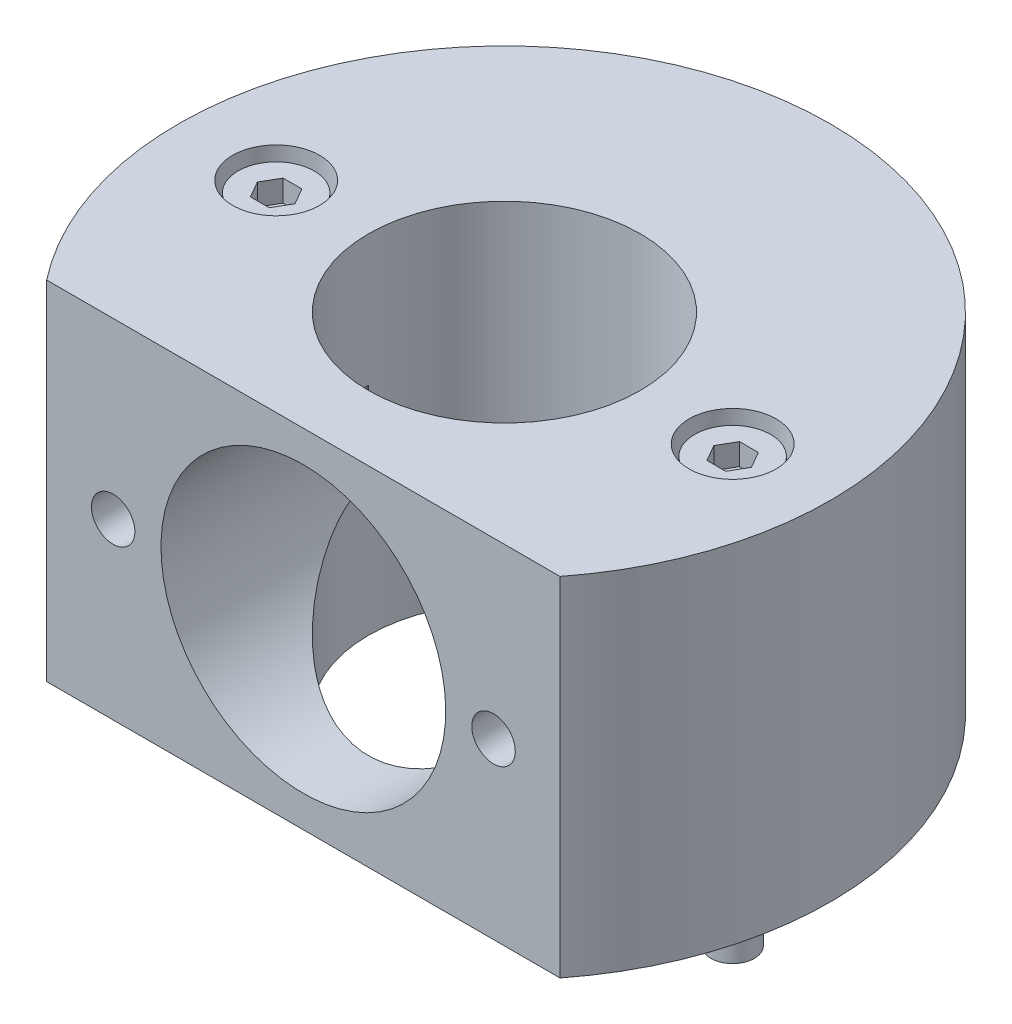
ISO-10303-21;
HEADER;
FILE_DESCRIPTION(('STEP AP214'),'2;1');
FILE_NAME('part.step','',(''),(''),'','','');
FILE_SCHEMA(('AUTOMOTIVE_DESIGN { 1 0 10303 214 1 1 1 1 }'));
ENDSEC;
DATA;
#1=APPLICATION_CONTEXT('core data for automotive mechanical design processes');
#2=APPLICATION_PROTOCOL_DEFINITION('international standard','automotive_design',2000,#1);
#3=PRODUCT_CONTEXT('',#1,'mechanical');
#4=PRODUCT('Part','Part','',(#3));
#5=PRODUCT_RELATED_PRODUCT_CATEGORY('part','',(#4));
#6=PRODUCT_DEFINITION_FORMATION('','',#4);
#7=PRODUCT_DEFINITION_CONTEXT('part definition',#1,'design');
#8=PRODUCT_DEFINITION('design','',#6,#7);
#9=PRODUCT_DEFINITION_SHAPE('','',#8);
#10=(LENGTH_UNIT() NAMED_UNIT(*) SI_UNIT(.MILLI.,.METRE.));
#11=(NAMED_UNIT(*) PLANE_ANGLE_UNIT() SI_UNIT($,.RADIAN.));
#12=(NAMED_UNIT(*) SI_UNIT($,.STERADIAN.) SOLID_ANGLE_UNIT());
#13=UNCERTAINTY_MEASURE_WITH_UNIT(LENGTH_MEASURE(1.E-05),#10,'distance_accuracy_value','');
#14=(GEOMETRIC_REPRESENTATION_CONTEXT(3) GLOBAL_UNCERTAINTY_ASSIGNED_CONTEXT((#13)) GLOBAL_UNIT_ASSIGNED_CONTEXT((#10,
#11,#12)) REPRESENTATION_CONTEXT('',''));
#15=CARTESIAN_POINT('',(0.,0.,0.));
#16=DIRECTION('',(0.,0.,1.));
#17=DIRECTION('',(1.,0.,0.));
#18=AXIS2_PLACEMENT_3D('',#15,#16,#17);
#19=CARTESIAN_POINT('',(-21.,-8.00000000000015,2.));
#20=DIRECTION('',(0.,-1.,0.));
#21=DIRECTION('',(0.,0.,-1.));
#22=AXIS2_PLACEMENT_3D('',#19,#20,#21);
#23=PLANE('',#22);
#24=CARTESIAN_POINT('',(-21.,-8.00000000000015,0.));
#25=DIRECTION('',(0.,1.,0.));
#26=DIRECTION('',(0.,0.,1.));
#27=AXIS2_PLACEMENT_3D('',#24,#25,#26);
#28=CIRCLE('',#27,2.);
#29=CARTESIAN_POINT('',(-21.,-8.00000000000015,2.));
#30=VERTEX_POINT('',#29);
#31=EDGE_CURVE('E339',#30,#30,#28,.T.);
#32=ORIENTED_EDGE('',*,*,#31,.F.);
#33=EDGE_LOOP('',(#32));
#34=FACE_BOUND('',#33,.T.);
#35=ADVANCED_FACE('F14',(#34),#23,.T.);
#36=CARTESIAN_POINT('',(-21.,11.9999999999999,0.));
#37=DIRECTION('',(0.,1.,0.));
#38=DIRECTION('',(0.,0.,1.));
#39=AXIS2_PLACEMENT_3D('',#36,#37,#38);
#40=CYLINDRICAL_SURFACE('',#39,2.);
#41=ORIENTED_EDGE('',*,*,#31,.T.);
#42=EDGE_LOOP('',(#41));
#43=FACE_BOUND('',#42,.T.);
#44=CARTESIAN_POINT('',(-21.,27.,0.));
#45=DIRECTION('',(0.,1.,0.));
#46=DIRECTION('',(0.,0.,1.));
#47=AXIS2_PLACEMENT_3D('',#44,#45,#46);
#48=CIRCLE('',#47,2.);
#49=CARTESIAN_POINT('',(-21.,27.,2.));
#50=VERTEX_POINT('',#49);
#51=EDGE_CURVE('E342',#50,#50,#48,.T.);
#52=ORIENTED_EDGE('',*,*,#51,.F.);
#53=EDGE_LOOP('',(#52));
#54=FACE_BOUND('',#53,.T.);
#55=ADVANCED_FACE('F258',(#43,#54),#40,.T.);
#56=CARTESIAN_POINT('',(-21.,27.,3.5));
#57=DIRECTION('',(0.,-1.,0.));
#58=DIRECTION('',(0.,0.,-1.));
#59=AXIS2_PLACEMENT_3D('',#56,#57,#58);
#60=PLANE('',#59);
#61=ORIENTED_EDGE('',*,*,#51,.T.);
#62=EDGE_LOOP('',(#61));
#63=FACE_BOUND('',#62,.T.);
#64=CARTESIAN_POINT('',(-21.,27.,0.));
#65=DIRECTION('',(0.,-1.,0.));
#66=DIRECTION('',(0.,0.,1.));
#67=AXIS2_PLACEMENT_3D('',#64,#65,#66);
#68=CIRCLE('',#67,2.25);
#69=CARTESIAN_POINT('',(-21.,27.,2.25));
#70=VERTEX_POINT('',#69);
#71=EDGE_CURVE('E9',#70,#70,#68,.T.);
#72=ORIENTED_EDGE('',*,*,#71,.T.);
#73=EDGE_LOOP('',(#72));
#74=FACE_BOUND('',#73,.T.);
#75=ADVANCED_FACE('F219',(#63,#74),#60,.T.);
#76=CARTESIAN_POINT('',(-19.2679491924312,29.,0.));
#77=DIRECTION('',(-0.86602540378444,0.,-0.5));
#78=DIRECTION('',(-0.5,0.,0.86602540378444));
#79=AXIS2_PLACEMENT_3D('',#76,#77,#78);
#80=PLANE('',#79);
#81=DIRECTION('',(0.,1.,0.));
#82=VECTOR('',#81,1.);
#83=CARTESIAN_POINT('',(-20.1339745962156,29.,1.5));
#84=LINE('',#83,#82);
#85=CARTESIAN_POINT('',(-20.1339745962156,29.,1.5));
#86=VERTEX_POINT('',#85);
#87=CARTESIAN_POINT('',(-20.1339745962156,31.,1.5));
#88=VERTEX_POINT('',#87);
#89=EDGE_CURVE('E337',#86,#88,#84,.T.);
#90=ORIENTED_EDGE('',*,*,#89,.T.);
#91=DIRECTION('',(-0.5,0.,0.86602540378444));
#92=VECTOR('',#91,1.);
#93=CARTESIAN_POINT('',(-19.2679491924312,31.,0.));
#94=LINE('',#93,#92);
#95=CARTESIAN_POINT('',(-19.2679491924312,31.,0.));
#96=VERTEX_POINT('',#95);
#97=EDGE_CURVE('E33',#96,#88,#94,.T.);
#98=ORIENTED_EDGE('',*,*,#97,.F.);
#99=DIRECTION('',(0.,1.,0.));
#100=VECTOR('',#99,1.);
#101=CARTESIAN_POINT('',(-19.2679491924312,29.,0.));
#102=LINE('',#101,#100);
#103=CARTESIAN_POINT('',(-19.2679491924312,29.,0.));
#104=VERTEX_POINT('',#103);
#105=EDGE_CURVE('E309',#104,#96,#102,.T.);
#106=ORIENTED_EDGE('',*,*,#105,.F.);
#107=DIRECTION('',(-0.5,0.,0.86602540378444));
#108=VECTOR('',#107,1.);
#109=CARTESIAN_POINT('',(-19.2679491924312,29.,0.));
#110=LINE('',#109,#108);
#111=EDGE_CURVE('E297',#104,#86,#110,.T.);
#112=ORIENTED_EDGE('',*,*,#111,.T.);
#113=EDGE_LOOP('',(#90,#98,#106,#112));
#114=FACE_BOUND('',#113,.T.);
#115=ADVANCED_FACE('F209',(#114),#80,.T.);
#116=CARTESIAN_POINT('',(-21.8660254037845,29.,1.5));
#117=DIRECTION('',(0.,0.,1.));
#118=DIRECTION('',(1.,0.,0.));
#119=AXIS2_PLACEMENT_3D('',#116,#117,#118);
#120=PLANE('',#119);
#121=DIRECTION('',(0.,1.,0.));
#122=VECTOR('',#121,1.);
#123=CARTESIAN_POINT('',(-21.8660254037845,29.,1.5));
#124=LINE('',#123,#122);
#125=CARTESIAN_POINT('',(-21.8660254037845,29.,1.5));
#126=VERTEX_POINT('',#125);
#127=CARTESIAN_POINT('',(-21.8660254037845,31.,1.5));
#128=VERTEX_POINT('',#127);
#129=EDGE_CURVE('E334',#126,#128,#124,.T.);
#130=ORIENTED_EDGE('',*,*,#129,.T.);
#131=DIRECTION('',(1.,0.,0.));
#132=VECTOR('',#131,1.);
#133=CARTESIAN_POINT('',(-21.8660254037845,31.,1.5));
#134=LINE('',#133,#132);
#135=EDGE_CURVE('E808',#128,#88,#134,.T.);
#136=ORIENTED_EDGE('',*,*,#135,.T.);
#137=ORIENTED_EDGE('',*,*,#89,.F.);
#138=DIRECTION('',(1.,0.,0.));
#139=VECTOR('',#138,1.);
#140=CARTESIAN_POINT('',(-21.8660254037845,29.,1.5));
#141=LINE('',#140,#139);
#142=EDGE_CURVE('E304',#126,#86,#141,.T.);
#143=ORIENTED_EDGE('',*,*,#142,.F.);
#144=EDGE_LOOP('',(#130,#136,#137,#143));
#145=FACE_BOUND('',#144,.T.);
#146=ADVANCED_FACE('F266',(#145),#120,.F.);
#147=CARTESIAN_POINT('',(-22.732050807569,29.,0.));
#148=DIRECTION('',(-0.86602540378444,0.,0.5));
#149=DIRECTION('',(0.5,0.,0.86602540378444));
#150=AXIS2_PLACEMENT_3D('',#147,#148,#149);
#151=PLANE('',#150);
#152=DIRECTION('',(0.,1.,0.));
#153=VECTOR('',#152,1.);
#154=CARTESIAN_POINT('',(-22.732050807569,29.,0.));
#155=LINE('',#154,#153);
#156=CARTESIAN_POINT('',(-22.732050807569,29.,0.));
#157=VERTEX_POINT('',#156);
#158=CARTESIAN_POINT('',(-22.732050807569,31.,0.));
#159=VERTEX_POINT('',#158);
#160=EDGE_CURVE('E331',#157,#159,#155,.T.);
#161=ORIENTED_EDGE('',*,*,#160,.T.);
#162=DIRECTION('',(0.5,0.,0.86602540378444));
#163=VECTOR('',#162,1.);
#164=CARTESIAN_POINT('',(-22.732050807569,31.,0.));
#165=LINE('',#164,#163);
#166=EDGE_CURVE('E812',#159,#128,#165,.T.);
#167=ORIENTED_EDGE('',*,*,#166,.T.);
#168=ORIENTED_EDGE('',*,*,#129,.F.);
#169=DIRECTION('',(0.5,0.,0.86602540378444));
#170=VECTOR('',#169,1.);
#171=CARTESIAN_POINT('',(-22.732050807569,29.,0.));
#172=LINE('',#171,#170);
#173=EDGE_CURVE('E324',#157,#126,#172,.T.);
#174=ORIENTED_EDGE('',*,*,#173,.F.);
#175=EDGE_LOOP('',(#161,#167,#168,#174));
#176=FACE_BOUND('',#175,.T.);
#177=ADVANCED_FACE('F269',(#176),#151,.F.);
#178=CARTESIAN_POINT('',(-22.732050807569,29.,0.));
#179=DIRECTION('',(0.86602540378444,0.,0.5));
#180=DIRECTION('',(0.5,0.,-0.86602540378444));
#181=AXIS2_PLACEMENT_3D('',#178,#179,#180);
#182=PLANE('',#181);
#183=DIRECTION('',(0.,1.,0.));
#184=VECTOR('',#183,1.);
#185=CARTESIAN_POINT('',(-21.8660254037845,29.,-1.5));
#186=LINE('',#185,#184);
#187=CARTESIAN_POINT('',(-21.8660254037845,29.,-1.5));
#188=VERTEX_POINT('',#187);
#189=CARTESIAN_POINT('',(-21.8660254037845,31.,-1.5));
#190=VERTEX_POINT('',#189);
#191=EDGE_CURVE('E328',#188,#190,#186,.T.);
#192=ORIENTED_EDGE('',*,*,#191,.T.);
#193=DIRECTION('',(0.5,0.,-0.86602540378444));
#194=VECTOR('',#193,1.);
#195=CARTESIAN_POINT('',(-22.732050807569,31.,0.));
#196=LINE('',#195,#194);
#197=EDGE_CURVE('E815',#159,#190,#196,.T.);
#198=ORIENTED_EDGE('',*,*,#197,.F.);
#199=ORIENTED_EDGE('',*,*,#160,.F.);
#200=DIRECTION('',(0.5,0.,-0.86602540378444));
#201=VECTOR('',#200,1.);
#202=CARTESIAN_POINT('',(-22.732050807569,29.,0.));
#203=LINE('',#202,#201);
#204=EDGE_CURVE('E317',#157,#188,#203,.T.);
#205=ORIENTED_EDGE('',*,*,#204,.T.);
#206=EDGE_LOOP('',(#192,#198,#199,#205));
#207=FACE_BOUND('',#206,.T.);
#208=ADVANCED_FACE('F273',(#207),#182,.T.);
#209=CARTESIAN_POINT('',(-20.1339745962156,29.,-1.5));
#210=DIRECTION('',(0.,0.,-1.));
#211=DIRECTION('',(-1.,0.,0.));
#212=AXIS2_PLACEMENT_3D('',#209,#210,#211);
#213=PLANE('',#212);
#214=DIRECTION('',(0.,1.,0.));
#215=VECTOR('',#214,1.);
#216=CARTESIAN_POINT('',(-20.1339745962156,29.,-1.5));
#217=LINE('',#216,#215);
#218=CARTESIAN_POINT('',(-20.1339745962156,29.,-1.5));
#219=VERTEX_POINT('',#218);
#220=CARTESIAN_POINT('',(-20.1339745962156,31.,-1.5));
#221=VERTEX_POINT('',#220);
#222=EDGE_CURVE('E312',#219,#221,#217,.T.);
#223=ORIENTED_EDGE('',*,*,#222,.T.);
#224=DIRECTION('',(-1.,0.,0.));
#225=VECTOR('',#224,1.);
#226=CARTESIAN_POINT('',(-20.1339745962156,31.,-1.5));
#227=LINE('',#226,#225);
#228=EDGE_CURVE('E820',#221,#190,#227,.T.);
#229=ORIENTED_EDGE('',*,*,#228,.T.);
#230=ORIENTED_EDGE('',*,*,#191,.F.);
#231=DIRECTION('',(-1.,0.,0.));
#232=VECTOR('',#231,1.);
#233=CARTESIAN_POINT('',(-20.1339745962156,29.,-1.5));
#234=LINE('',#233,#232);
#235=EDGE_CURVE('E314',#219,#188,#234,.T.);
#236=ORIENTED_EDGE('',*,*,#235,.F.);
#237=EDGE_LOOP('',(#223,#229,#230,#236));
#238=FACE_BOUND('',#237,.T.);
#239=ADVANCED_FACE('F277',(#238),#213,.F.);
#240=CARTESIAN_POINT('',(-19.2679491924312,29.,0.));
#241=DIRECTION('',(0.86602540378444,0.,-0.5));
#242=DIRECTION('',(-0.5,0.,-0.86602540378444));
#243=AXIS2_PLACEMENT_3D('',#240,#241,#242);
#244=PLANE('',#243);
#245=DIRECTION('',(-0.5,0.,-0.86602540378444));
#246=VECTOR('',#245,1.);
#247=CARTESIAN_POINT('',(-19.2679491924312,29.,0.));
#248=LINE('',#247,#246);
#249=EDGE_CURVE('E300',#104,#219,#248,.T.);
#250=ORIENTED_EDGE('',*,*,#249,.F.);
#251=ORIENTED_EDGE('',*,*,#105,.T.);
#252=DIRECTION('',(-0.5,0.,-0.86602540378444));
#253=VECTOR('',#252,1.);
#254=CARTESIAN_POINT('',(-19.2679491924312,31.,0.));
#255=LINE('',#254,#253);
#256=EDGE_CURVE('E305',#96,#221,#255,.T.);
#257=ORIENTED_EDGE('',*,*,#256,.T.);
#258=ORIENTED_EDGE('',*,*,#222,.F.);
#259=EDGE_LOOP('',(#250,#251,#257,#258));
#260=FACE_BOUND('',#259,.T.);
#261=ADVANCED_FACE('F252',(#260),#244,.F.);
#262=CARTESIAN_POINT('',(-20.1339745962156,29.,1.5));
#263=DIRECTION('',(0.,1.,0.));
#264=DIRECTION('',(0.,0.,1.));
#265=AXIS2_PLACEMENT_3D('',#262,#263,#264);
#266=PLANE('',#265);
#267=ORIENTED_EDGE('',*,*,#111,.F.);
#268=ORIENTED_EDGE('',*,*,#249,.T.);
#269=ORIENTED_EDGE('',*,*,#235,.T.);
#270=ORIENTED_EDGE('',*,*,#204,.F.);
#271=ORIENTED_EDGE('',*,*,#173,.T.);
#272=ORIENTED_EDGE('',*,*,#142,.T.);
#273=EDGE_LOOP('',(#267,#268,#269,#270,#271,#272));
#274=FACE_BOUND('',#273,.T.);
#275=ADVANCED_FACE('F250',(#274),#266,.T.);
#276=CARTESIAN_POINT('',(-21.,31.,0.));
#277=DIRECTION('',(0.,1.,0.));
#278=DIRECTION('',(0.,0.,1.));
#279=AXIS2_PLACEMENT_3D('',#276,#277,#278);
#280=PLANE('',#279);
#281=CARTESIAN_POINT('',(-21.,31.,0.));
#282=DIRECTION('',(0.,1.,0.));
#283=DIRECTION('',(0.,0.,1.));
#284=AXIS2_PLACEMENT_3D('',#281,#282,#283);
#285=CIRCLE('',#284,3.5);
#286=CARTESIAN_POINT('',(-21.,31.,3.5));
#287=VERTEX_POINT('',#286);
#288=EDGE_CURVE('E24',#287,#287,#285,.T.);
#289=ORIENTED_EDGE('',*,*,#288,.T.);
#290=EDGE_LOOP('',(#289));
#291=FACE_BOUND('',#290,.T.);
#292=ORIENTED_EDGE('',*,*,#256,.F.);
#293=ORIENTED_EDGE('',*,*,#97,.T.);
#294=ORIENTED_EDGE('',*,*,#135,.F.);
#295=ORIENTED_EDGE('',*,*,#166,.F.);
#296=ORIENTED_EDGE('',*,*,#197,.T.);
#297=ORIENTED_EDGE('',*,*,#228,.F.);
#298=EDGE_LOOP('',(#292,#293,#294,#295,#296,#297));
#299=FACE_BOUND('',#298,.T.);
#300=ADVANCED_FACE('F247',(#291,#299),#280,.T.);
#301=CARTESIAN_POINT('',(-21.,11.9999999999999,0.));
#302=DIRECTION('',(0.,1.,0.));
#303=DIRECTION('',(0.,0.,1.));
#304=AXIS2_PLACEMENT_3D('',#301,#302,#303);
#305=CYLINDRICAL_SURFACE('',#304,3.5);
#306=CARTESIAN_POINT('',(-21.,27.,0.));
#307=DIRECTION('',(0.,1.,0.));
#308=DIRECTION('',(0.,0.,1.));
#309=AXIS2_PLACEMENT_3D('',#306,#307,#308);
#310=CIRCLE('',#309,3.5);
#311=CARTESIAN_POINT('',(-21.,27.,3.5));
#312=VERTEX_POINT('',#311);
#313=EDGE_CURVE('E345',#312,#312,#310,.T.);
#314=ORIENTED_EDGE('',*,*,#313,.T.);
#315=EDGE_LOOP('',(#314));
#316=FACE_BOUND('',#315,.T.);
#317=ORIENTED_EDGE('',*,*,#288,.F.);
#318=EDGE_LOOP('',(#317));
#319=FACE_BOUND('',#318,.T.);
#320=ADVANCED_FACE('F245',(#316,#319),#305,.T.);
#321=CARTESIAN_POINT('',(21.8660254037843,29.,1.5));
#322=DIRECTION('',(0.,1.,0.));
#323=DIRECTION('',(0.,0.,1.));
#324=AXIS2_PLACEMENT_3D('',#321,#322,#323);
#325=PLANE('',#324);
#326=DIRECTION('',(-0.5,0.,0.86602540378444));
#327=VECTOR('',#326,1.);
#328=CARTESIAN_POINT('',(22.7320508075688,29.,0.));
#329=LINE('',#328,#327);
#330=CARTESIAN_POINT('',(22.7320508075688,29.,0.));
#331=VERTEX_POINT('',#330);
#332=CARTESIAN_POINT('',(21.8660254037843,29.,1.5));
#333=VERTEX_POINT('',#332);
#334=EDGE_CURVE('E353',#331,#333,#329,.T.);
#335=ORIENTED_EDGE('',*,*,#334,.F.);
#336=DIRECTION('',(-0.5,0.,-0.86602540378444));
#337=VECTOR('',#336,1.);
#338=CARTESIAN_POINT('',(22.7320508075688,29.,0.));
#339=LINE('',#338,#337);
#340=CARTESIAN_POINT('',(21.8660254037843,29.,-1.5));
#341=VERTEX_POINT('',#340);
#342=EDGE_CURVE('E369',#331,#341,#339,.T.);
#343=ORIENTED_EDGE('',*,*,#342,.T.);
#344=DIRECTION('',(-1.,0.,0.));
#345=VECTOR('',#344,1.);
#346=CARTESIAN_POINT('',(21.8660254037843,29.,-1.5));
#347=LINE('',#346,#345);
#348=CARTESIAN_POINT('',(20.1339745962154,29.,-1.5));
#349=VERTEX_POINT('',#348);
#350=EDGE_CURVE('E373',#341,#349,#347,.T.);
#351=ORIENTED_EDGE('',*,*,#350,.T.);
#352=DIRECTION('',(0.5,0.,-0.86602540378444));
#353=VECTOR('',#352,1.);
#354=CARTESIAN_POINT('',(19.267949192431,29.,0.));
#355=LINE('',#354,#353);
#356=CARTESIAN_POINT('',(19.267949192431,29.,0.));
#357=VERTEX_POINT('',#356);
#358=EDGE_CURVE('E376',#357,#349,#355,.T.);
#359=ORIENTED_EDGE('',*,*,#358,.F.);
#360=DIRECTION('',(0.5,0.,0.86602540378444));
#361=VECTOR('',#360,1.);
#362=CARTESIAN_POINT('',(19.267949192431,29.,0.));
#363=LINE('',#362,#361);
#364=CARTESIAN_POINT('',(20.1339745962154,29.,1.5));
#365=VERTEX_POINT('',#364);
#366=EDGE_CURVE('E379',#357,#365,#363,.T.);
#367=ORIENTED_EDGE('',*,*,#366,.T.);
#368=DIRECTION('',(1.,0.,0.));
#369=VECTOR('',#368,1.);
#370=CARTESIAN_POINT('',(20.1339745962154,29.,1.5));
#371=LINE('',#370,#369);
#372=EDGE_CURVE('E382',#365,#333,#371,.T.);
#373=ORIENTED_EDGE('',*,*,#372,.T.);
#374=EDGE_LOOP('',(#335,#343,#351,#359,#367,#373));
#375=FACE_BOUND('',#374,.T.);
#376=ADVANCED_FACE('F235',(#375),#325,.T.);
#377=CARTESIAN_POINT('',(21.8660254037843,29.,-1.5));
#378=DIRECTION('',(0.,0.,-1.));
#379=DIRECTION('',(-1.,0.,0.));
#380=AXIS2_PLACEMENT_3D('',#377,#378,#379);
#381=PLANE('',#380);
#382=DIRECTION('',(0.,1.,0.));
#383=VECTOR('',#382,1.);
#384=CARTESIAN_POINT('',(21.8660254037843,29.,-1.5));
#385=LINE('',#384,#383);
#386=CARTESIAN_POINT('',(21.8660254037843,31.,-1.5));
#387=VERTEX_POINT('',#386);
#388=EDGE_CURVE('E389',#341,#387,#385,.T.);
#389=ORIENTED_EDGE('',*,*,#388,.T.);
#390=DIRECTION('',(-1.,0.,0.));
#391=VECTOR('',#390,1.);
#392=CARTESIAN_POINT('',(21.8660254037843,31.,-1.5));
#393=LINE('',#392,#391);
#394=CARTESIAN_POINT('',(20.1339745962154,31.,-1.5));
#395=VERTEX_POINT('',#394);
#396=EDGE_CURVE('E354',#387,#395,#393,.T.);
#397=ORIENTED_EDGE('',*,*,#396,.T.);
#398=DIRECTION('',(0.,1.,0.));
#399=VECTOR('',#398,1.);
#400=CARTESIAN_POINT('',(20.1339745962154,29.,-1.5));
#401=LINE('',#400,#399);
#402=EDGE_CURVE('E391',#349,#395,#401,.T.);
#403=ORIENTED_EDGE('',*,*,#402,.F.);
#404=ORIENTED_EDGE('',*,*,#350,.F.);
#405=EDGE_LOOP('',(#389,#397,#403,#404));
#406=FACE_BOUND('',#405,.T.);
#407=ADVANCED_FACE('F231',(#406),#381,.F.);
#408=CARTESIAN_POINT('',(19.267949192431,29.,0.));
#409=DIRECTION('',(0.86602540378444,0.,0.5));
#410=DIRECTION('',(0.5,0.,-0.86602540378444));
#411=AXIS2_PLACEMENT_3D('',#408,#409,#410);
#412=PLANE('',#411);
#413=ORIENTED_EDGE('',*,*,#402,.T.);
#414=DIRECTION('',(0.5,0.,-0.86602540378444));
#415=VECTOR('',#414,1.);
#416=CARTESIAN_POINT('',(19.267949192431,31.,0.));
#417=LINE('',#416,#415);
#418=CARTESIAN_POINT('',(19.267949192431,31.,0.));
#419=VERTEX_POINT('',#418);
#420=EDGE_CURVE('E357',#419,#395,#417,.T.);
#421=ORIENTED_EDGE('',*,*,#420,.F.);
#422=DIRECTION('',(0.,1.,0.));
#423=VECTOR('',#422,1.);
#424=CARTESIAN_POINT('',(19.267949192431,29.,0.));
#425=LINE('',#424,#423);
#426=EDGE_CURVE('E393',#357,#419,#425,.T.);
#427=ORIENTED_EDGE('',*,*,#426,.F.);
#428=ORIENTED_EDGE('',*,*,#358,.T.);
#429=EDGE_LOOP('',(#413,#421,#427,#428));
#430=FACE_BOUND('',#429,.T.);
#431=ADVANCED_FACE('F227',(#430),#412,.T.);
#432=CARTESIAN_POINT('',(19.267949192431,29.,0.));
#433=DIRECTION('',(-0.86602540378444,0.,0.5));
#434=DIRECTION('',(0.5,0.,0.86602540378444));
#435=AXIS2_PLACEMENT_3D('',#432,#433,#434);
#436=PLANE('',#435);
#437=ORIENTED_EDGE('',*,*,#426,.T.);
#438=DIRECTION('',(0.5,0.,0.86602540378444));
#439=VECTOR('',#438,1.);
#440=CARTESIAN_POINT('',(19.267949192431,31.,0.));
#441=LINE('',#440,#439);
#442=CARTESIAN_POINT('',(20.1339745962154,31.,1.5));
#443=VERTEX_POINT('',#442);
#444=EDGE_CURVE('E360',#419,#443,#441,.T.);
#445=ORIENTED_EDGE('',*,*,#444,.T.);
#446=DIRECTION('',(0.,1.,0.));
#447=VECTOR('',#446,1.);
#448=CARTESIAN_POINT('',(20.1339745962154,29.,1.5));
#449=LINE('',#448,#447);
#450=EDGE_CURVE('E395',#365,#443,#449,.T.);
#451=ORIENTED_EDGE('',*,*,#450,.F.);
#452=ORIENTED_EDGE('',*,*,#366,.F.);
#453=EDGE_LOOP('',(#437,#445,#451,#452));
#454=FACE_BOUND('',#453,.T.);
#455=ADVANCED_FACE('F223',(#454),#436,.F.);
#456=CARTESIAN_POINT('',(20.1339745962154,29.,1.5));
#457=DIRECTION('',(0.,0.,1.));
#458=DIRECTION('',(1.,0.,0.));
#459=AXIS2_PLACEMENT_3D('',#456,#457,#458);
#460=PLANE('',#459);
#461=ORIENTED_EDGE('',*,*,#450,.T.);
#462=DIRECTION('',(1.,0.,0.));
#463=VECTOR('',#462,1.);
#464=CARTESIAN_POINT('',(20.1339745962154,31.,1.5));
#465=LINE('',#464,#463);
#466=CARTESIAN_POINT('',(21.8660254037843,31.,1.5));
#467=VERTEX_POINT('',#466);
#468=EDGE_CURVE('E363',#443,#467,#465,.T.);
#469=ORIENTED_EDGE('',*,*,#468,.T.);
#470=DIRECTION('',(0.,1.,0.));
#471=VECTOR('',#470,1.);
#472=CARTESIAN_POINT('',(21.8660254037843,29.,1.5));
#473=LINE('',#472,#471);
#474=EDGE_CURVE('E397',#333,#467,#473,.T.);
#475=ORIENTED_EDGE('',*,*,#474,.F.);
#476=ORIENTED_EDGE('',*,*,#372,.F.);
#477=EDGE_LOOP('',(#461,#469,#475,#476));
#478=FACE_BOUND('',#477,.T.);
#479=ADVANCED_FACE('F220',(#478),#460,.F.);
#480=CARTESIAN_POINT('',(22.7320508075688,29.,0.));
#481=DIRECTION('',(-0.86602540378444,0.,-0.5));
#482=DIRECTION('',(-0.5,0.,0.86602540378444));
#483=AXIS2_PLACEMENT_3D('',#480,#481,#482);
#484=PLANE('',#483);
#485=ORIENTED_EDGE('',*,*,#474,.T.);
#486=DIRECTION('',(-0.5,0.,0.86602540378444));
#487=VECTOR('',#486,1.);
#488=CARTESIAN_POINT('',(22.7320508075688,31.,0.));
#489=LINE('',#488,#487);
#490=CARTESIAN_POINT('',(22.7320508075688,31.,0.));
#491=VERTEX_POINT('',#490);
#492=EDGE_CURVE('E366',#491,#467,#489,.T.);
#493=ORIENTED_EDGE('',*,*,#492,.F.);
#494=DIRECTION('',(0.,1.,0.));
#495=VECTOR('',#494,1.);
#496=CARTESIAN_POINT('',(22.7320508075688,29.,0.));
#497=LINE('',#496,#495);
#498=EDGE_CURVE('E372',#331,#491,#497,.T.);
#499=ORIENTED_EDGE('',*,*,#498,.F.);
#500=ORIENTED_EDGE('',*,*,#334,.T.);
#501=EDGE_LOOP('',(#485,#493,#499,#500));
#502=FACE_BOUND('',#501,.T.);
#503=ADVANCED_FACE('F199',(#502),#484,.T.);
#504=CARTESIAN_POINT('',(22.7320508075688,29.,0.));
#505=DIRECTION('',(0.86602540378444,0.,-0.5));
#506=DIRECTION('',(-0.5,0.,-0.86602540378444));
#507=AXIS2_PLACEMENT_3D('',#504,#505,#506);
#508=PLANE('',#507);
#509=ORIENTED_EDGE('',*,*,#342,.F.);
#510=ORIENTED_EDGE('',*,*,#498,.T.);
#511=DIRECTION('',(-0.5,0.,-0.86602540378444));
#512=VECTOR('',#511,1.);
#513=CARTESIAN_POINT('',(22.7320508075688,31.,0.));
#514=LINE('',#513,#512);
#515=EDGE_CURVE('E350',#491,#387,#514,.T.);
#516=ORIENTED_EDGE('',*,*,#515,.T.);
#517=ORIENTED_EDGE('',*,*,#388,.F.);
#518=EDGE_LOOP('',(#509,#510,#516,#517));
#519=FACE_BOUND('',#518,.T.);
#520=ADVANCED_FACE('F204',(#519),#508,.F.);
#521=CARTESIAN_POINT('',(21.,31.,0.));
#522=DIRECTION('',(0.,1.,0.));
#523=DIRECTION('',(0.,0.,1.));
#524=AXIS2_PLACEMENT_3D('',#521,#522,#523);
#525=PLANE('',#524);
#526=CARTESIAN_POINT('',(21.,31.,0.));
#527=DIRECTION('',(0.,1.,0.));
#528=DIRECTION('',(0.,0.,1.));
#529=AXIS2_PLACEMENT_3D('',#526,#527,#528);
#530=CIRCLE('',#529,3.5);
#531=CARTESIAN_POINT('',(21.,31.,3.5));
#532=VERTEX_POINT('',#531);
#533=EDGE_CURVE('E408',#532,#532,#530,.T.);
#534=ORIENTED_EDGE('',*,*,#533,.T.);
#535=EDGE_LOOP('',(#534));
#536=FACE_BOUND('',#535,.T.);
#537=ORIENTED_EDGE('',*,*,#515,.F.);
#538=ORIENTED_EDGE('',*,*,#492,.T.);
#539=ORIENTED_EDGE('',*,*,#468,.F.);
#540=ORIENTED_EDGE('',*,*,#444,.F.);
#541=ORIENTED_EDGE('',*,*,#420,.T.);
#542=ORIENTED_EDGE('',*,*,#396,.F.);
#543=EDGE_LOOP('',(#537,#538,#539,#540,#541,#542));
#544=FACE_BOUND('',#543,.T.);
#545=ADVANCED_FACE('F200',(#536,#544),#525,.T.);
#546=CARTESIAN_POINT('',(21.,12.0000000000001,0.));
#547=DIRECTION('',(0.,1.,0.));
#548=DIRECTION('',(0.,0.,1.));
#549=AXIS2_PLACEMENT_3D('',#546,#547,#548);
#550=CYLINDRICAL_SURFACE('',#549,3.5);
#551=CARTESIAN_POINT('',(21.,27.,0.));
#552=DIRECTION('',(0.,1.,0.));
#553=DIRECTION('',(0.,0.,1.));
#554=AXIS2_PLACEMENT_3D('',#551,#552,#553);
#555=CIRCLE('',#554,3.5);
#556=CARTESIAN_POINT('',(21.,27.,3.5));
#557=VERTEX_POINT('',#556);
#558=EDGE_CURVE('E405',#557,#557,#555,.T.);
#559=ORIENTED_EDGE('',*,*,#558,.T.);
#560=EDGE_LOOP('',(#559));
#561=FACE_BOUND('',#560,.T.);
#562=ORIENTED_EDGE('',*,*,#533,.F.);
#563=EDGE_LOOP('',(#562));
#564=FACE_BOUND('',#563,.T.);
#565=ADVANCED_FACE('F203',(#561,#564),#550,.T.);
#566=CARTESIAN_POINT('',(21.,-7.99999999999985,2.));
#567=DIRECTION('',(0.,-1.,0.));
#568=DIRECTION('',(0.,0.,-1.));
#569=AXIS2_PLACEMENT_3D('',#566,#567,#568);
#570=PLANE('',#569);
#571=CARTESIAN_POINT('',(21.,-7.99999999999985,0.));
#572=DIRECTION('',(0.,1.,0.));
#573=DIRECTION('',(0.,0.,1.));
#574=AXIS2_PLACEMENT_3D('',#571,#572,#573);
#575=CIRCLE('',#574,2.);
#576=CARTESIAN_POINT('',(21.,-7.99999999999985,2.));
#577=VERTEX_POINT('',#576);
#578=EDGE_CURVE('E399',#577,#577,#575,.T.);
#579=ORIENTED_EDGE('',*,*,#578,.F.);
#580=EDGE_LOOP('',(#579));
#581=FACE_BOUND('',#580,.T.);
#582=ADVANCED_FACE('F165',(#581),#570,.T.);
#583=CARTESIAN_POINT('',(18.75,27.,0.));
#584=DIRECTION('',(0.,-1.,0.));
#585=DIRECTION('',(1.,0.,0.));
#586=AXIS2_PLACEMENT_3D('',#583,#584,#585);
#587=PLANE('',#586);
#588=ORIENTED_EDGE('',*,*,#558,.F.);
#589=EDGE_LOOP('',(#588));
#590=FACE_BOUND('',#589,.T.);
#591=CARTESIAN_POINT('',(21.,27.,0.));
#592=DIRECTION('',(0.,1.,0.));
#593=DIRECTION('',(-1.,0.,0.));
#594=AXIS2_PLACEMENT_3D('',#591,#592,#593);
#595=CIRCLE('',#594,4.);
#596=CARTESIAN_POINT('',(17.,27.,0.));
#597=VERTEX_POINT('',#596);
#598=EDGE_CURVE('E438',#597,#597,#595,.T.);
#599=ORIENTED_EDGE('',*,*,#598,.T.);
#600=EDGE_LOOP('',(#599));
#601=FACE_BOUND('',#600,.T.);
#602=ADVANCED_FACE('F161',(#590,#601),#587,.F.);
#603=CARTESIAN_POINT('',(17.5,16.,10.5));
#604=DIRECTION('',(0.,0.,-1.));
#605=DIRECTION('',(0.,-1.,0.));
#606=AXIS2_PLACEMENT_3D('',#603,#604,#605);
#607=PLANE('',#606);
#608=CARTESIAN_POINT('',(17.5,16.,10.5));
#609=DIRECTION('',(0.,0.,1.));
#610=DIRECTION('',(0.,1.,0.));
#611=AXIS2_PLACEMENT_3D('',#608,#609,#610);
#612=CIRCLE('',#611,2.);
#613=CARTESIAN_POINT('',(17.5,18.,10.5));
#614=VERTEX_POINT('',#613);
#615=EDGE_CURVE('E423',#614,#614,#612,.T.);
#616=ORIENTED_EDGE('',*,*,#615,.T.);
#617=EDGE_LOOP('',(#616));
#618=FACE_BOUND('',#617,.T.);
#619=ADVANCED_FACE('F164',(#618),#607,.F.);
#620=CARTESIAN_POINT('',(-17.5,16.,10.5));
#621=DIRECTION('',(0.,0.,-1.));
#622=DIRECTION('',(0.,-1.,0.));
#623=AXIS2_PLACEMENT_3D('',#620,#621,#622);
#624=PLANE('',#623);
#625=CARTESIAN_POINT('',(-17.5,16.,10.5));
#626=DIRECTION('',(0.,0.,1.));
#627=DIRECTION('',(0.,1.,0.));
#628=AXIS2_PLACEMENT_3D('',#625,#626,#627);
#629=CIRCLE('',#628,2.);
#630=CARTESIAN_POINT('',(-17.5,18.,10.5));
#631=VERTEX_POINT('',#630);
#632=EDGE_CURVE('E417',#631,#631,#629,.T.);
#633=ORIENTED_EDGE('',*,*,#632,.T.);
#634=EDGE_LOOP('',(#633));
#635=FACE_BOUND('',#634,.T.);
#636=ADVANCED_FACE('F187',(#635),#624,.F.);
#637=CARTESIAN_POINT('',(21.,12.0000000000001,0.));
#638=DIRECTION('',(0.,1.,0.));
#639=DIRECTION('',(0.,0.,1.));
#640=AXIS2_PLACEMENT_3D('',#637,#638,#639);
#641=CYLINDRICAL_SURFACE('',#640,2.);
#642=ORIENTED_EDGE('',*,*,#578,.T.);
#643=EDGE_LOOP('',(#642));
#644=FACE_BOUND('',#643,.T.);
#645=CARTESIAN_POINT('',(21.,27.,0.));
#646=DIRECTION('',(0.,1.,0.));
#647=DIRECTION('',(0.,0.,1.));
#648=AXIS2_PLACEMENT_3D('',#645,#646,#647);
#649=CIRCLE('',#648,2.);
#650=CARTESIAN_POINT('',(21.,27.,2.));
#651=VERTEX_POINT('',#650);
#652=EDGE_CURVE('E402',#651,#651,#649,.T.);
#653=ORIENTED_EDGE('',*,*,#652,.F.);
#654=EDGE_LOOP('',(#653));
#655=FACE_BOUND('',#654,.T.);
#656=ADVANCED_FACE('F169',(#644,#655),#641,.T.);
#657=CARTESIAN_POINT('',(21.,32.,0.));
#658=DIRECTION('',(0.,1.,0.));
#659=DIRECTION('',(-1.,0.,0.));
#660=AXIS2_PLACEMENT_3D('',#657,#658,#659);
#661=CYLINDRICAL_SURFACE('',#660,4.);
#662=ORIENTED_EDGE('',*,*,#598,.F.);
#663=EDGE_LOOP('',(#662));
#664=FACE_BOUND('',#663,.T.);
#665=CARTESIAN_POINT('',(21.,32.,0.));
#666=DIRECTION('',(0.,1.,0.));
#667=DIRECTION('',(-1.,0.,0.));
#668=AXIS2_PLACEMENT_3D('',#665,#666,#667);
#669=CIRCLE('',#668,4.);
#670=CARTESIAN_POINT('',(17.,32.,0.));
#671=VERTEX_POINT('',#670);
#672=EDGE_CURVE('E435',#671,#671,#669,.T.);
#673=ORIENTED_EDGE('',*,*,#672,.T.);
#674=EDGE_LOOP('',(#673));
#675=FACE_BOUND('',#674,.T.);
#676=ADVANCED_FACE('F155',(#664,#675),#661,.F.);
#677=CARTESIAN_POINT('',(0.,16.,0.));
#678=DIRECTION('',(0.,0.,1.));
#679=DIRECTION('',(0.,1.,0.));
#680=AXIS2_PLACEMENT_3D('',#677,#678,#679);
#681=PLANE('',#680);
#682=CARTESIAN_POINT('',(0.,16.,0.));
#683=DIRECTION('',(0.,0.,1.));
#684=DIRECTION('',(0.,1.,0.));
#685=AXIS2_PLACEMENT_3D('',#682,#683,#684);
#686=CIRCLE('',#685,13.1);
#687=CARTESIAN_POINT('',(12.5,12.080816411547,0.));
#688=VERTEX_POINT('',#687);
#689=CARTESIAN_POINT('',(12.5,19.9191835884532,0.));
#690=VERTEX_POINT('',#689);
#691=EDGE_CURVE('E448',#688,#690,#686,.T.);
#692=ORIENTED_EDGE('',*,*,#691,.T.);
#693=DIRECTION('',(0.,-1.,0.));
#694=VECTOR('',#693,1.);
#695=CARTESIAN_POINT('',(12.5,32.,0.));
#696=LINE('',#695,#694);
#697=EDGE_CURVE('E126',#688,#690,#696,.F.);
#698=ORIENTED_EDGE('',*,*,#697,.F.);
#699=EDGE_LOOP('',(#692,#698));
#700=FACE_BOUND('',#699,.T.);
#701=ADVANCED_FACE('F151',(#700),#681,.T.);
#702=CARTESIAN_POINT('',(-12.5,19.919183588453,0.));
#703=VERTEX_POINT('',#702);
#704=CARTESIAN_POINT('',(-12.5,12.0808164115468,0.));
#705=VERTEX_POINT('',#704);
#706=EDGE_CURVE('E445',#703,#705,#686,.T.);
#707=ORIENTED_EDGE('',*,*,#706,.T.);
#708=DIRECTION('',(0.,-1.,0.));
#709=VECTOR('',#708,1.);
#710=CARTESIAN_POINT('',(-12.5,32.,0.));
#711=LINE('',#710,#709);
#712=EDGE_CURVE('E18',#703,#705,#711,.T.);
#713=ORIENTED_EDGE('',*,*,#712,.F.);
#714=EDGE_LOOP('',(#707,#713));
#715=FACE_BOUND('',#714,.T.);
#716=ADVANCED_FACE('F149',(#715),#681,.T.);
#717=CARTESIAN_POINT('',(0.,16.,0.));
#718=DIRECTION('',(0.,0.,1.));
#719=DIRECTION('',(0.,1.,0.));
#720=AXIS2_PLACEMENT_3D('',#717,#718,#719);
#721=CYLINDRICAL_SURFACE('',#720,13.1);
#722=CARTESIAN_POINT('',(-12.5,19.919183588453,0.));
#723=CARTESIAN_POINT('',(-12.5000215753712,19.9190576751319,0.126361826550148));
#724=CARTESIAN_POINT('',(-12.4980849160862,19.925292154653,0.252637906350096));
#725=CARTESIAN_POINT('',(-12.490473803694,19.9494733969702,0.503625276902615));
#726=CARTESIAN_POINT('',(-12.484809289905,19.9673890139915,0.628339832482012));
#727=CARTESIAN_POINT('',(-12.4700610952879,20.0134910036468,0.873141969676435));
#728=CARTESIAN_POINT('',(-12.4610445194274,20.0414754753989,0.993272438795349));
#729=CARTESIAN_POINT('',(-12.4398224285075,20.1063355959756,1.23087351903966));
#730=CARTESIAN_POINT('',(-12.4276146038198,20.143217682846,1.34834213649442));
#731=CARTESIAN_POINT('',(-12.3916315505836,20.2499771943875,1.653398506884));
#732=CARTESIAN_POINT('',(-12.3654139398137,20.3260039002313,1.83854217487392));
#733=CARTESIAN_POINT('',(-12.3060362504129,20.4921334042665,2.20120355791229));
#734=CARTESIAN_POINT('',(-12.2728710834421,20.5822465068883,2.378715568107));
#735=CARTESIAN_POINT('',(-12.1997803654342,20.7734647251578,2.7290564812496));
#736=CARTESIAN_POINT('',(-12.1597787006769,20.8746884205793,2.9018039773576));
#737=CARTESIAN_POINT('',(-12.0737083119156,21.0841321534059,3.24133098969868));
#738=CARTESIAN_POINT('',(-12.0276409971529,21.1923505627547,3.40811188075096));
#739=CARTESIAN_POINT('',(-11.9212403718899,21.4326911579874,3.76488978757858));
#740=CARTESIAN_POINT('',(-11.8598161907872,21.5657230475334,3.95394538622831));
#741=CARTESIAN_POINT('',(-11.7291389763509,21.8360835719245,4.3262233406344));
#742=CARTESIAN_POINT('',(-11.6598841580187,21.9734131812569,4.50944435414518));
#743=CARTESIAN_POINT('',(-11.5135741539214,22.2507771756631,4.87089838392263));
#744=CARTESIAN_POINT('',(-11.4365128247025,22.3908136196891,5.04912732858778));
#745=CARTESIAN_POINT('',(-11.2746354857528,22.672254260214,5.40093211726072));
#746=CARTESIAN_POINT('',(-11.1898186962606,22.8136585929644,5.57450749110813));
#747=CARTESIAN_POINT('',(-10.9241678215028,23.2376429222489,6.0877642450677));
#748=CARTESIAN_POINT('',(-10.7317052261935,23.5208184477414,6.42103004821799));
#749=CARTESIAN_POINT('',(-10.3151607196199,24.0826886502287,7.07079837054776));
#750=CARTESIAN_POINT('',(-10.0910955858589,24.3613856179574,7.38730966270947));
#751=CARTESIAN_POINT('',(-9.64253179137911,24.8730664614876,7.96152443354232));
#752=CARTESIAN_POINT('',(-9.42212127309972,25.1071683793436,8.2214219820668));
#753=CARTESIAN_POINT('',(-8.95607962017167,25.5658531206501,8.72678535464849));
#754=CARTESIAN_POINT('',(-8.71044548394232,25.7904348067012,8.97224945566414));
#755=CARTESIAN_POINT('',(-8.1937777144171,26.2267387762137,9.44641603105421));
#756=CARTESIAN_POINT('',(-7.92278050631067,26.4384788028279,9.67514172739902));
#757=CARTESIAN_POINT('',(-7.3546865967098,26.8462339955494,10.1137187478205));
#758=CARTESIAN_POINT('',(-7.05758778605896,27.0422478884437,10.3235685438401));
#759=CARTESIAN_POINT('',(-6.51618250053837,27.3675972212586,10.6707515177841));
#760=CARTESIAN_POINT('',(-6.27758905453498,27.5012381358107,10.8129809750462));
#761=CARTESIAN_POINT('',(-5.78643016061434,27.7560067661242,11.0835813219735));
#762=CARTESIAN_POINT('',(-5.53387286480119,27.8771416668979,11.211960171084));
#763=CARTESIAN_POINT('',(-5.01533051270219,28.1052332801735,11.4533063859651));
#764=CARTESIAN_POINT('',(-4.74934649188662,28.2121910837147,11.5662749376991));
#765=CARTESIAN_POINT('',(-4.20496325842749,28.4101633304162,11.7751118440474));
#766=CARTESIAN_POINT('',(-3.92656384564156,28.5011775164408,11.8709799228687));
#767=CARTESIAN_POINT('',(-3.35610145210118,28.6663172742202,12.0447637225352));
#768=CARTESIAN_POINT('',(-3.06393179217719,28.7402697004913,12.1224954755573));
#769=CARTESIAN_POINT('',(-2.47058039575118,28.8685017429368,12.2571922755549));
#770=CARTESIAN_POINT('',(-2.1693986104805,28.9227812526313,12.3141572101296));
#771=CARTESIAN_POINT('',(-1.5609214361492,29.0103001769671,12.4059704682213));
#772=CARTESIAN_POINT('',(-1.2536316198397,29.0435579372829,12.4408380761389));
#773=CARTESIAN_POINT('',(-0.635750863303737,29.0882279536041,12.487664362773));
#774=CARTESIAN_POINT('',(-0.325160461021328,29.0996437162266,12.4996267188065));
#775=CARTESIAN_POINT('',(0.250503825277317,29.1002890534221,12.5003028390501));
#776=CARTESIAN_POINT('',(0.515579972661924,29.0925238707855,12.4921657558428));
#777=CARTESIAN_POINT('',(1.04370920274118,29.0610345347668,12.4591592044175));
#778=CARTESIAN_POINT('',(1.30676252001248,29.0373122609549,12.4342917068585));
#779=CARTESIAN_POINT('',(1.8289323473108,28.9743662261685,12.3682770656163));
#780=CARTESIAN_POINT('',(2.08804873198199,28.9351419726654,12.32712940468));
#781=CARTESIAN_POINT('',(2.60061223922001,28.8419109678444,12.2292640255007));
#782=CARTESIAN_POINT('',(2.85405913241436,28.7879036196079,12.1725456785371));
#783=CARTESIAN_POINT('',(3.34939537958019,28.6670992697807,12.0455709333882));
#784=CARTESIAN_POINT('',(3.59140955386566,28.6005436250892,11.9755698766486));
#785=CARTESIAN_POINT('',(4.06747682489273,28.455023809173,11.8223598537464));
#786=CARTESIAN_POINT('',(4.30152688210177,28.3760549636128,11.739145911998));
#787=CARTESIAN_POINT('',(4.76066994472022,28.2067965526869,11.56056629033));
#788=CARTESIAN_POINT('',(4.98576402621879,28.116508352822,11.4652020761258));
#789=CARTESIAN_POINT('',(5.42642430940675,27.9256698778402,11.2633336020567));
#790=CARTESIAN_POINT('',(5.64198849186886,27.8251174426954,11.1568269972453));
#791=CARTESIAN_POINT('',(6.16182838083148,27.5655225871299,10.8813751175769));
#792=CARTESIAN_POINT('',(6.46035562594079,27.401146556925,10.7065530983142));
#793=CARTESIAN_POINT('',(7.03521200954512,27.055693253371,10.3379153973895));
#794=CARTESIAN_POINT('',(7.31153264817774,26.874609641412,10.144092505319));
#795=CARTESIAN_POINT('',(7.84245562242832,26.4981917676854,9.73948464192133));
#796=CARTESIAN_POINT('',(8.09700189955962,26.3028229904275,9.52865845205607));
#797=CARTESIAN_POINT('',(8.58380205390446,25.9009088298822,9.09258692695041));
#798=CARTESIAN_POINT('',(8.81605677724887,25.69436387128,8.86734213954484));
#799=CARTESIAN_POINT('',(9.3347561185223,25.2000526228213,8.32451991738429));
#800=CARTESIAN_POINT('',(9.61244476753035,24.9087379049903,8.00178319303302));
#801=CARTESIAN_POINT('',(10.1298329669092,24.3157350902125,7.33583298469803));
#802=CARTESIAN_POINT('',(10.3695105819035,24.014041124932,6.99260783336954));
#803=CARTESIAN_POINT('',(10.8117374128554,23.4065533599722,6.28725411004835));
#804=CARTESIAN_POINT('',(11.0143307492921,23.1007649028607,5.92514866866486));
#805=CARTESIAN_POINT('',(11.2911429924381,22.6446818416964,5.36685158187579));
#806=CARTESIAN_POINT('',(11.3788834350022,22.4931225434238,5.1782752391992));
#807=CARTESIAN_POINT('',(11.5454086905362,22.1921772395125,4.79553198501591));
#808=CARTESIAN_POINT('',(11.6241949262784,22.0427908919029,4.60136596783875));
#809=CARTESIAN_POINT('',(11.7573824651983,21.7785034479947,4.24757484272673));
#810=CARTESIAN_POINT('',(11.8134544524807,21.6628685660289,4.08912562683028));
#811=CARTESIAN_POINT('',(11.9198670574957,21.4353047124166,3.76768352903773));
#812=CARTESIAN_POINT('',(11.9702076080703,21.3233757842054,3.60469059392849));
#813=CARTESIAN_POINT('',(12.0650200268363,21.1048471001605,3.27337836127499));
#814=CARTESIAN_POINT('',(12.1094897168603,20.9982493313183,3.10505711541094));
#815=CARTESIAN_POINT('',(12.1922447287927,20.7928539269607,2.76228495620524));
#816=CARTESIAN_POINT('',(12.2305318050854,20.6940540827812,2.58783579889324));
#817=CARTESIAN_POINT('',(12.3137521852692,20.4721584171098,2.16431507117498));
#818=CARTESIAN_POINT('',(12.3557199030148,20.3540120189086,1.9119808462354));
#819=CARTESIAN_POINT('',(12.4249064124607,20.1524888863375,1.39264730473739));
#820=CARTESIAN_POINT('',(12.452211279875,20.068909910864,1.12574393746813));
#821=CARTESIAN_POINT('',(12.480408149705,19.981261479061,0.713392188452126));
#822=CARTESIAN_POINT('',(12.4876868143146,19.9582978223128,0.572403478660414));
#823=CARTESIAN_POINT('',(12.4975139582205,19.9271152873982,0.287681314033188));
#824=CARTESIAN_POINT('',(12.5000294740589,19.9189991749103,0.143935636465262));
#825=CARTESIAN_POINT('',(12.5,19.9191835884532,0.));
#826=B_SPLINE_CURVE_WITH_KNOTS('',3,(#722,#723,#724,#725,#726,#727,#728,#729,#730,#731,#732,
#733,#734,#735,#736,#737,#738,#739,#740,#741,#742,#743,#744,#745,#746,#747,#748,#749,#750,#751,
#752,#753,#754,#755,#756,#757,#758,#759,#760,#761,#762,#763,#764,#765,#766,#767,#768,#769,#770,
#771,#772,#773,#774,#775,#776,#777,#778,#779,#780,#781,#782,#783,#784,#785,#786,#787,#788,#789,
#790,#791,#792,#793,#794,#795,#796,#797,#798,#799,#800,#801,#802,#803,#804,#805,#806,#807,#808,
#809,#810,#811,#812,#813,#814,#815,#816,#817,#818,#819,#820,#821,#822,#823,#824,#825),
.UNSPECIFIED.,.F.,.F.,(4,2,2,2,2,2,2,2,2,2,2,2,2,2,2,2,2,2,2,2,2,2,2,2,2,2,2,2,2,2,2,2,2,2,2,2,
2,2,2,2,2,2,2,2,2,2,2,2,2,2,2,4),(0.,0.378779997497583,0.756554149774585,1.1271406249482,
1.49799605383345,2.10247062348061,2.70738946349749,3.31954349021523,3.93155554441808,
4.64884343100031,5.36629515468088,6.08431594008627,6.80240899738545,8.23439178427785,
9.66561718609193,10.9048990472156,12.1443285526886,13.3820045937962,14.6197807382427,
15.5437344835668,16.4671544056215,17.3905032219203,18.3138669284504,19.2462249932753,
20.1785881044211,21.1101364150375,22.041535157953,22.8364852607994,23.6313417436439,
24.4262234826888,25.2211373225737,26.0020861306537,26.7833297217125,27.5644791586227,
28.345793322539,29.4931196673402,30.6408830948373,31.7915177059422,32.9421086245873,
34.4875553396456,36.0338906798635,37.5783741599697,38.3502551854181,39.1220133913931,
39.7339160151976,40.3458258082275,40.957961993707,41.5699241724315,42.4134068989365,
43.2518824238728,43.6801695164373,44.1114098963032),.UNSPECIFIED.);
#827=EDGE_CURVE('E136',#703,#690,#826,.T.);
#828=ORIENTED_EDGE('',*,*,#827,.T.);
#829=ORIENTED_EDGE('',*,*,#691,.F.);
#830=CARTESIAN_POINT('',(12.5,12.080816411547,0.));
#831=CARTESIAN_POINT('',(12.5000215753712,12.0809423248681,0.126361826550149));
#832=CARTESIAN_POINT('',(12.4980849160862,12.074707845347,0.252637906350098));
#833=CARTESIAN_POINT('',(12.490473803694,12.0505266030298,0.503625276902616));
#834=CARTESIAN_POINT('',(12.484809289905,12.0326109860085,0.628339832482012));
#835=CARTESIAN_POINT('',(12.4700610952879,11.9865089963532,0.873141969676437));
#836=CARTESIAN_POINT('',(12.4610445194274,11.9585245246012,0.993272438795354));
#837=CARTESIAN_POINT('',(12.4398224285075,11.8936644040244,1.23087351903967));
#838=CARTESIAN_POINT('',(12.4276146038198,11.8567823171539,1.34834213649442));
#839=CARTESIAN_POINT('',(12.3916315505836,11.7500228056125,1.65339850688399));
#840=CARTESIAN_POINT('',(12.3654139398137,11.6739960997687,1.83854217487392));
#841=CARTESIAN_POINT('',(12.3060362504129,11.5078665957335,2.20120355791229));
#842=CARTESIAN_POINT('',(12.2728710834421,11.4177534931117,2.37871556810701));
#843=CARTESIAN_POINT('',(12.1997803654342,11.2265352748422,2.72905648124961));
#844=CARTESIAN_POINT('',(12.1597787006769,11.1253115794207,2.9018039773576));
#845=CARTESIAN_POINT('',(12.0737083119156,10.9158678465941,3.24133098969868));
#846=CARTESIAN_POINT('',(12.0276409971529,10.8076494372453,3.40811188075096));
#847=CARTESIAN_POINT('',(11.9212403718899,10.5673088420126,3.76488978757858));
#848=CARTESIAN_POINT('',(11.8598161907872,10.4342769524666,3.95394538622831));
#849=CARTESIAN_POINT('',(11.7291389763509,10.1639164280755,4.3262233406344));
#850=CARTESIAN_POINT('',(11.6598841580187,10.0265868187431,4.50944435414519));
#851=CARTESIAN_POINT('',(11.5135741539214,9.74922282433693,4.87089838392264));
#852=CARTESIAN_POINT('',(11.4365128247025,9.6091863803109,5.04912732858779));
#853=CARTESIAN_POINT('',(11.2746354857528,9.32774573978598,5.40093211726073));
#854=CARTESIAN_POINT('',(11.1898186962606,9.18634140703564,5.57450749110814));
#855=CARTESIAN_POINT('',(10.9241678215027,8.76235707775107,6.0877642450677));
#856=CARTESIAN_POINT('',(10.7317052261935,8.47918155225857,6.42103004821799));
#857=CARTESIAN_POINT('',(10.3151607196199,7.91731134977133,7.07079837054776));
#858=CARTESIAN_POINT('',(10.0910955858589,7.63861438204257,7.38730966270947));
#859=CARTESIAN_POINT('',(9.64253179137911,7.1269335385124,7.96152443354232));
#860=CARTESIAN_POINT('',(9.42212127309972,6.8928316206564,8.22142198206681));
#861=CARTESIAN_POINT('',(8.95607962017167,6.43414687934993,8.7267853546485));
#862=CARTESIAN_POINT('',(8.71044548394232,6.20956519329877,8.97224945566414));
#863=CARTESIAN_POINT('',(8.1937777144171,5.7732612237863,9.44641603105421));
#864=CARTESIAN_POINT('',(7.92278050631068,5.56152119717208,9.67514172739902));
#865=CARTESIAN_POINT('',(7.35468659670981,5.15376600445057,10.1137187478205));
#866=CARTESIAN_POINT('',(7.05758778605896,4.95775211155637,10.3235685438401));
#867=CARTESIAN_POINT('',(6.51618250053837,4.63240277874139,10.6707515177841));
#868=CARTESIAN_POINT('',(6.27758905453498,4.49876186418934,10.8129809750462));
#869=CARTESIAN_POINT('',(5.78643016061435,4.2439932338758,11.0835813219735));
#870=CARTESIAN_POINT('',(5.53387286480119,4.12285833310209,11.211960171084));
#871=CARTESIAN_POINT('',(5.01533051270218,3.89476671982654,11.4533063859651));
#872=CARTESIAN_POINT('',(4.74934649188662,3.78780891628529,11.5662749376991));
#873=CARTESIAN_POINT('',(4.20496325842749,3.58983666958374,11.7751118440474));
#874=CARTESIAN_POINT('',(3.92656384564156,3.49882248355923,11.8709799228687));
#875=CARTESIAN_POINT('',(3.35610145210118,3.33368272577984,12.0447637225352));
#876=CARTESIAN_POINT('',(3.06393179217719,3.25973029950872,12.1224954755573));
#877=CARTESIAN_POINT('',(2.47058039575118,3.13149825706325,12.2571922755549));
#878=CARTESIAN_POINT('',(2.1693986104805,3.07721874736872,12.3141572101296));
#879=CARTESIAN_POINT('',(1.5609214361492,2.98969982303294,12.4059704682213));
#880=CARTESIAN_POINT('',(1.2536316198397,2.95644206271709,12.4408380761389));
#881=CARTESIAN_POINT('',(0.635750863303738,2.91177204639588,12.487664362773));
#882=CARTESIAN_POINT('',(0.325160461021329,2.90035628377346,12.4996267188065));
#883=CARTESIAN_POINT('',(-0.250503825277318,2.89971094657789,12.5003028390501));
#884=CARTESIAN_POINT('',(-0.515579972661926,2.90747612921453,12.4921657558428));
#885=CARTESIAN_POINT('',(-1.04370920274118,2.93896546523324,12.4591592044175));
#886=CARTESIAN_POINT('',(-1.30676252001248,2.96268773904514,12.4342917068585));
#887=CARTESIAN_POINT('',(-1.8289323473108,3.02563377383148,12.3682770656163));
#888=CARTESIAN_POINT('',(-2.08804873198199,3.06485802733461,12.32712940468));
#889=CARTESIAN_POINT('',(-2.60061223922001,3.15808903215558,12.2292640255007));
#890=CARTESIAN_POINT('',(-2.85405913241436,3.21209638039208,12.1725456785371));
#891=CARTESIAN_POINT('',(-3.34939537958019,3.33290073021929,12.0455709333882));
#892=CARTESIAN_POINT('',(-3.59140955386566,3.39945637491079,11.9755698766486));
#893=CARTESIAN_POINT('',(-4.06747682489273,3.54497619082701,11.8223598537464));
#894=CARTESIAN_POINT('',(-4.30152688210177,3.62394503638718,11.739145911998));
#895=CARTESIAN_POINT('',(-4.76066994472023,3.79320344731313,11.56056629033));
#896=CARTESIAN_POINT('',(-4.98576402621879,3.88349164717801,11.4652020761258));
#897=CARTESIAN_POINT('',(-5.42642430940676,4.07433012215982,11.2633336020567));
#898=CARTESIAN_POINT('',(-5.64198849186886,4.17488255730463,11.1568269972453));
#899=CARTESIAN_POINT('',(-6.16182838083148,4.43447741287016,10.8813751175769));
#900=CARTESIAN_POINT('',(-6.4603556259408,4.59885344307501,10.7065530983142));
#901=CARTESIAN_POINT('',(-7.03521200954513,4.94430674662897,10.3379153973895));
#902=CARTESIAN_POINT('',(-7.31153264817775,5.12539035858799,10.144092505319));
#903=CARTESIAN_POINT('',(-7.84245562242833,5.50180823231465,9.73948464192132));
#904=CARTESIAN_POINT('',(-8.09700189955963,5.69717700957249,9.52865845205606));
#905=CARTESIAN_POINT('',(-8.58380205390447,6.09909117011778,9.09258692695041));
#906=CARTESIAN_POINT('',(-8.81605677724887,6.30563612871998,8.86734213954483));
#907=CARTESIAN_POINT('',(-9.33475611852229,6.79994737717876,8.32451991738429));
#908=CARTESIAN_POINT('',(-9.61244476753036,7.09126209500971,8.00178319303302));
#909=CARTESIAN_POINT('',(-10.1298329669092,7.68426490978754,7.33583298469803));
#910=CARTESIAN_POINT('',(-10.3695105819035,7.98595887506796,6.99260783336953));
#911=CARTESIAN_POINT('',(-10.8117374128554,8.59344664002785,6.28725411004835));
#912=CARTESIAN_POINT('',(-11.0143307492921,8.89923509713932,5.92514866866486));
#913=CARTESIAN_POINT('',(-11.2911429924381,9.35531815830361,5.36685158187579));
#914=CARTESIAN_POINT('',(-11.3788834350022,9.50687745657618,5.1782752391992));
#915=CARTESIAN_POINT('',(-11.5454086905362,9.80782276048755,4.7955319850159));
#916=CARTESIAN_POINT('',(-11.6241949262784,9.95720910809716,4.60136596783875));
#917=CARTESIAN_POINT('',(-11.7573824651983,10.2214965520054,4.24757484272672));
#918=CARTESIAN_POINT('',(-11.8134544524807,10.3371314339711,4.08912562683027));
#919=CARTESIAN_POINT('',(-11.9198670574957,10.5646952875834,3.76768352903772));
#920=CARTESIAN_POINT('',(-11.9702076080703,10.6766242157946,3.60469059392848));
#921=CARTESIAN_POINT('',(-12.0650200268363,10.8951528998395,3.27337836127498));
#922=CARTESIAN_POINT('',(-12.1094897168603,11.0017506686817,3.10505711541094));
#923=CARTESIAN_POINT('',(-12.1922447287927,11.2071460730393,2.76228495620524));
#924=CARTESIAN_POINT('',(-12.2305318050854,11.3059459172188,2.58783579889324));
#925=CARTESIAN_POINT('',(-12.3137521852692,11.5278415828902,2.16431507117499));
#926=CARTESIAN_POINT('',(-12.3557199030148,11.6459879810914,1.9119808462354));
#927=CARTESIAN_POINT('',(-12.4249064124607,11.8475111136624,1.39264730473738));
#928=CARTESIAN_POINT('',(-12.452211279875,11.931090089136,1.12574393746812));
#929=CARTESIAN_POINT('',(-12.480408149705,12.018738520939,0.713392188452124));
#930=CARTESIAN_POINT('',(-12.4876868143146,12.0417021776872,0.572403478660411));
#931=CARTESIAN_POINT('',(-12.4975139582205,12.0728847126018,0.287681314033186));
#932=CARTESIAN_POINT('',(-12.5000294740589,12.0810008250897,0.143935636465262));
#933=CARTESIAN_POINT('',(-12.5,12.0808164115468,0.));
#934=B_SPLINE_CURVE_WITH_KNOTS('',3,(#830,#831,#832,#833,#834,#835,#836,#837,#838,#839,#840,
#841,#842,#843,#844,#845,#846,#847,#848,#849,#850,#851,#852,#853,#854,#855,#856,#857,#858,#859,
#860,#861,#862,#863,#864,#865,#866,#867,#868,#869,#870,#871,#872,#873,#874,#875,#876,#877,#878,
#879,#880,#881,#882,#883,#884,#885,#886,#887,#888,#889,#890,#891,#892,#893,#894,#895,#896,#897,
#898,#899,#900,#901,#902,#903,#904,#905,#906,#907,#908,#909,#910,#911,#912,#913,#914,#915,#916,
#917,#918,#919,#920,#921,#922,#923,#924,#925,#926,#927,#928,#929,#930,#931,#932,#933),
.UNSPECIFIED.,.F.,.F.,(4,2,2,2,2,2,2,2,2,2,2,2,2,2,2,2,2,2,2,2,2,2,2,2,2,2,2,2,2,2,2,2,2,2,2,2,
2,2,2,2,2,2,2,2,2,2,2,2,2,2,2,4),(0.,0.378779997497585,0.756554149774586,1.1271406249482,
1.49799605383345,2.10247062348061,2.7073894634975,3.31954349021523,3.93155554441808,
4.64884343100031,5.36629515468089,6.08431594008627,6.80240899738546,8.23439178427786,
9.66561718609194,10.9048990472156,12.1443285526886,13.3820045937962,14.6197807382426,
15.5437344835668,16.4671544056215,17.3905032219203,18.3138669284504,19.2462249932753,
20.1785881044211,21.1101364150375,22.041535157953,22.8364852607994,23.6313417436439,
24.4262234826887,25.2211373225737,26.0020861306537,26.7833297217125,27.5644791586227,
28.345793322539,29.4931196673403,30.6408830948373,31.7915177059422,32.9421086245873,
34.4875553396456,36.0338906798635,37.5783741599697,38.3502551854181,39.1220133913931,
39.7339160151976,40.3458258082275,40.957961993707,41.5699241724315,42.4134068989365,
43.2518824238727,43.6801695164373,44.1114098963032),.UNSPECIFIED.);
#935=EDGE_CURVE('E129',#688,#705,#934,.T.);
#936=ORIENTED_EDGE('',*,*,#935,.T.);
#937=ORIENTED_EDGE('',*,*,#706,.F.);
#938=EDGE_LOOP('',(#828,#829,#936,#937));
#939=FACE_BOUND('',#938,.T.);
#940=CARTESIAN_POINT('',(0.,16.,18.5));
#941=DIRECTION('',(0.,0.,1.));
#942=DIRECTION('',(0.,1.,0.));
#943=AXIS2_PLACEMENT_3D('',#940,#941,#942);
#944=CIRCLE('',#943,13.1);
#945=CARTESIAN_POINT('',(0.,29.1,18.5));
#946=VERTEX_POINT('',#945);
#947=EDGE_CURVE('E444',#946,#946,#944,.T.);
#948=ORIENTED_EDGE('',*,*,#947,.T.);
#949=EDGE_LOOP('',(#948));
#950=FACE_BOUND('',#949,.T.);
#951=ADVANCED_FACE('F144',(#939,#950),#721,.F.);
#952=CARTESIAN_POINT('',(17.5,16.,18.5));
#953=DIRECTION('',(0.,0.,1.));
#954=DIRECTION('',(0.,1.,0.));
#955=AXIS2_PLACEMENT_3D('',#952,#953,#954);
#956=CYLINDRICAL_SURFACE('',#955,2.);
#957=ORIENTED_EDGE('',*,*,#615,.F.);
#958=EDGE_LOOP('',(#957));
#959=FACE_BOUND('',#958,.T.);
#960=CARTESIAN_POINT('',(17.5,16.,18.5));
#961=DIRECTION('',(0.,0.,1.));
#962=DIRECTION('',(0.,1.,0.));
#963=AXIS2_PLACEMENT_3D('',#960,#961,#962);
#964=CIRCLE('',#963,2.);
#965=CARTESIAN_POINT('',(17.5,18.,18.5));
#966=VERTEX_POINT('',#965);
#967=EDGE_CURVE('E420',#966,#966,#964,.T.);
#968=ORIENTED_EDGE('',*,*,#967,.T.);
#969=EDGE_LOOP('',(#968));
#970=FACE_BOUND('',#969,.T.);
#971=ADVANCED_FACE('F148',(#959,#970),#956,.F.);
#972=CARTESIAN_POINT('',(-17.5,16.,18.5));
#973=DIRECTION('',(0.,0.,1.));
#974=DIRECTION('',(0.,1.,0.));
#975=AXIS2_PLACEMENT_3D('',#972,#973,#974);
#976=CYLINDRICAL_SURFACE('',#975,2.);
#977=ORIENTED_EDGE('',*,*,#632,.F.);
#978=EDGE_LOOP('',(#977));
#979=FACE_BOUND('',#978,.T.);
#980=CARTESIAN_POINT('',(-17.5,16.,18.5));
#981=DIRECTION('',(0.,0.,1.));
#982=DIRECTION('',(0.,1.,0.));
#983=AXIS2_PLACEMENT_3D('',#980,#981,#982);
#984=CIRCLE('',#983,2.);
#985=CARTESIAN_POINT('',(-17.5,18.,18.5));
#986=VERTEX_POINT('',#985);
#987=EDGE_CURVE('E414',#986,#986,#984,.T.);
#988=ORIENTED_EDGE('',*,*,#987,.T.);
#989=EDGE_LOOP('',(#988));
#990=FACE_BOUND('',#989,.T.);
#991=ADVANCED_FACE('F191',(#979,#990),#976,.F.);
#992=CARTESIAN_POINT('',(-1.1172740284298E-13,32.,0.));
#993=DIRECTION('',(0.,1.,0.));
#994=DIRECTION('',(-1.,0.,0.));
#995=AXIS2_PLACEMENT_3D('',#992,#993,#994);
#996=PLANE('',#995);
#997=CARTESIAN_POINT('',(-21.,32.,0.));
#998=DIRECTION('',(0.,1.,0.));
#999=DIRECTION('',(-1.,0.,0.));
#1000=AXIS2_PLACEMENT_3D('',#997,#998,#999);
#1001=CIRCLE('',#1000,4.);
#1002=CARTESIAN_POINT('',(-25.,32.,0.));
#1003=VERTEX_POINT('',#1002);
#1004=EDGE_CURVE('E426',#1003,#1003,#1001,.T.);
#1005=ORIENTED_EDGE('',*,*,#1004,.F.);
#1006=EDGE_LOOP('',(#1005));
#1007=FACE_BOUND('',#1006,.T.);
#1008=ORIENTED_EDGE('',*,*,#672,.F.);
#1009=EDGE_LOOP('',(#1008));
#1010=FACE_BOUND('',#1009,.T.);
#1011=CARTESIAN_POINT('',(-1.1172740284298E-13,32.,0.));
#1012=DIRECTION('',(0.,1.,0.));
#1013=DIRECTION('',(-1.,0.,0.));
#1014=AXIS2_PLACEMENT_3D('',#1011,#1012,#1013);
#1015=CIRCLE('',#1014,30.);
#1016=CARTESIAN_POINT('',(23.616731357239,32.,18.5));
#1017=VERTEX_POINT('',#1016);
#1018=CARTESIAN_POINT('',(-23.6167313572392,32.,18.5));
#1019=VERTEX_POINT('',#1018);
#1020=EDGE_CURVE('E108',#1017,#1019,#1015,.T.);
#1021=ORIENTED_EDGE('',*,*,#1020,.T.);
#1022=DIRECTION('',(1.,0.,0.));
#1023=VECTOR('',#1022,1.);
#1024=CARTESIAN_POINT('',(23.616731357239,32.,18.5));
#1025=LINE('',#1024,#1023);
#1026=EDGE_CURVE('E113',#1019,#1017,#1025,.T.);
#1027=ORIENTED_EDGE('',*,*,#1026,.T.);
#1028=EDGE_LOOP('',(#1021,#1027));
#1029=FACE_BOUND('',#1028,.T.);
#1030=CARTESIAN_POINT('',(-1.1172740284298E-13,32.,0.));
#1031=DIRECTION('',(0.,1.,0.));
#1032=DIRECTION('',(-1.,0.,0.));
#1033=AXIS2_PLACEMENT_3D('',#1030,#1031,#1032);
#1034=CIRCLE('',#1033,12.5);
#1035=CARTESIAN_POINT('',(-12.5000000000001,31.9999999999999,0.));
#1036=VERTEX_POINT('',#1035);
#1037=EDGE_CURVE('E117',#1036,#1036,#1034,.T.);
#1038=ORIENTED_EDGE('',*,*,#1037,.F.);
#1039=EDGE_LOOP('',(#1038));
#1040=FACE_BOUND('',#1039,.T.);
#1041=ADVANCED_FACE('F183',(#1007,#1010,#1029,#1040),#996,.T.);
#1042=CARTESIAN_POINT('',(-21.,32.,0.));
#1043=DIRECTION('',(0.,1.,0.));
#1044=DIRECTION('',(-1.,0.,0.));
#1045=AXIS2_PLACEMENT_3D('',#1042,#1043,#1044);
#1046=CYLINDRICAL_SURFACE('',#1045,4.);
#1047=CARTESIAN_POINT('',(-21.,27.,0.));
#1048=DIRECTION('',(0.,1.,0.));
#1049=DIRECTION('',(-1.,0.,0.));
#1050=AXIS2_PLACEMENT_3D('',#1047,#1048,#1049);
#1051=CIRCLE('',#1050,4.);
#1052=CARTESIAN_POINT('',(-25.,27.,0.));
#1053=VERTEX_POINT('',#1052);
#1054=EDGE_CURVE('E429',#1053,#1053,#1051,.T.);
#1055=ORIENTED_EDGE('',*,*,#1054,.F.);
#1056=EDGE_LOOP('',(#1055));
#1057=FACE_BOUND('',#1056,.T.);
#1058=ORIENTED_EDGE('',*,*,#1004,.T.);
#1059=EDGE_LOOP('',(#1058));
#1060=FACE_BOUND('',#1059,.T.);
#1061=ADVANCED_FACE('F179',(#1057,#1060),#1046,.F.);
#1062=CARTESIAN_POINT('',(-23.25,27.,0.));
#1063=DIRECTION('',(0.,-1.,0.));
#1064=DIRECTION('',(1.,0.,0.));
#1065=AXIS2_PLACEMENT_3D('',#1062,#1063,#1064);
#1066=PLANE('',#1065);
#1067=ORIENTED_EDGE('',*,*,#313,.F.);
#1068=EDGE_LOOP('',(#1067));
#1069=FACE_BOUND('',#1068,.T.);
#1070=ORIENTED_EDGE('',*,*,#1054,.T.);
#1071=EDGE_LOOP('',(#1070));
#1072=FACE_BOUND('',#1071,.T.);
#1073=ADVANCED_FACE('F175',(#1069,#1072),#1066,.F.);
#1074=CARTESIAN_POINT('',(21.,27.,3.5));
#1075=DIRECTION('',(0.,-1.,0.));
#1076=DIRECTION('',(0.,0.,-1.));
#1077=AXIS2_PLACEMENT_3D('',#1074,#1075,#1076);
#1078=PLANE('',#1077);
#1079=ORIENTED_EDGE('',*,*,#652,.T.);
#1080=EDGE_LOOP('',(#1079));
#1081=FACE_BOUND('',#1080,.T.);
#1082=CARTESIAN_POINT('',(21.,27.,0.));
#1083=DIRECTION('',(0.,-1.,0.));
#1084=DIRECTION('',(0.,0.,1.));
#1085=AXIS2_PLACEMENT_3D('',#1082,#1083,#1084);
#1086=CIRCLE('',#1085,2.25);
#1087=CARTESIAN_POINT('',(21.,27.,2.25));
#1088=VERTEX_POINT('',#1087);
#1089=EDGE_CURVE('E411',#1088,#1088,#1086,.T.);
#1090=ORIENTED_EDGE('',*,*,#1089,.T.);
#1091=EDGE_LOOP('',(#1090));
#1092=FACE_BOUND('',#1091,.T.);
#1093=ADVANCED_FACE('F178',(#1081,#1092),#1078,.T.);
#1094=CARTESIAN_POINT('',(-1.1172740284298E-13,32.,0.));
#1095=DIRECTION('',(0.,-1.,0.));
#1096=DIRECTION('',(1.,0.,0.));
#1097=AXIS2_PLACEMENT_3D('',#1094,#1095,#1096);
#1098=CYLINDRICAL_SURFACE('',#1097,12.5);
#1099=ORIENTED_EDGE('',*,*,#1037,.T.);
#1100=EDGE_LOOP('',(#1099));
#1101=FACE_BOUND('',#1100,.T.);
#1102=CARTESIAN_POINT('',(1.1172740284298E-13,0.,0.));
#1103=DIRECTION('',(0.,1.,0.));
#1104=DIRECTION('',(-1.,0.,0.));
#1105=AXIS2_PLACEMENT_3D('',#1102,#1103,#1104);
#1106=CIRCLE('',#1105,12.5);
#1107=CARTESIAN_POINT('',(-12.4999999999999,0.,0.));
#1108=VERTEX_POINT('',#1107);
#1109=EDGE_CURVE('E120',#1108,#1108,#1106,.T.);
#1110=ORIENTED_EDGE('',*,*,#1109,.F.);
#1111=EDGE_LOOP('',(#1110));
#1112=FACE_BOUND('',#1111,.T.);
#1113=ORIENTED_EDGE('',*,*,#827,.F.);
#1114=ORIENTED_EDGE('',*,*,#712,.T.);
#1115=ORIENTED_EDGE('',*,*,#935,.F.);
#1116=ORIENTED_EDGE('',*,*,#697,.T.);
#1117=EDGE_LOOP('',(#1113,#1114,#1115,#1116));
#1118=FACE_BOUND('',#1117,.T.);
#1119=ADVANCED_FACE('F141',(#1101,#1112,#1118),#1098,.F.);
#1120=CARTESIAN_POINT('',(23.616731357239,32.,18.5));
#1121=DIRECTION('',(0.,0.,-1.));
#1122=DIRECTION('',(0.,-1.,0.));
#1123=AXIS2_PLACEMENT_3D('',#1120,#1121,#1122);
#1124=PLANE('',#1123);
#1125=ORIENTED_EDGE('',*,*,#987,.F.);
#1126=EDGE_LOOP('',(#1125));
#1127=FACE_BOUND('',#1126,.T.);
#1128=ORIENTED_EDGE('',*,*,#967,.F.);
#1129=EDGE_LOOP('',(#1128));
#1130=FACE_BOUND('',#1129,.T.);
#1131=ORIENTED_EDGE('',*,*,#947,.F.);
#1132=EDGE_LOOP('',(#1131));
#1133=FACE_BOUND('',#1132,.T.);
#1134=DIRECTION('',(1.,0.,0.));
#1135=VECTOR('',#1134,1.);
#1136=CARTESIAN_POINT('',(23.6167313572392,1.66533453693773E-13,18.5));
#1137=LINE('',#1136,#1135);
#1138=CARTESIAN_POINT('',(-23.616731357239,-1.66533453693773E-13,18.5));
#1139=VERTEX_POINT('',#1138);
#1140=CARTESIAN_POINT('',(23.6167313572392,1.66533453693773E-13,18.5));
#1141=VERTEX_POINT('',#1140);
#1142=EDGE_CURVE('E98',#1139,#1141,#1137,.T.);
#1143=ORIENTED_EDGE('',*,*,#1142,.T.);
#1144=DIRECTION('',(0.,-1.,0.));
#1145=VECTOR('',#1144,1.);
#1146=CARTESIAN_POINT('',(23.616731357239,32.,18.5));
#1147=LINE('',#1146,#1145);
#1148=EDGE_CURVE('E101',#1017,#1141,#1147,.T.);
#1149=ORIENTED_EDGE('',*,*,#1148,.F.);
#1150=ORIENTED_EDGE('',*,*,#1026,.F.);
#1151=DIRECTION('',(0.,-1.,0.));
#1152=VECTOR('',#1151,1.);
#1153=CARTESIAN_POINT('',(-23.6167313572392,32.,18.5));
#1154=LINE('',#1153,#1152);
#1155=EDGE_CURVE('E104',#1019,#1139,#1154,.T.);
#1156=ORIENTED_EDGE('',*,*,#1155,.T.);
#1157=EDGE_LOOP('',(#1143,#1149,#1150,#1156));
#1158=FACE_BOUND('',#1157,.T.);
#1159=ADVANCED_FACE('F100',(#1127,#1130,#1133,#1158),#1124,.F.);
#1160=CARTESIAN_POINT('',(-1.1172740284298E-13,32.,0.));
#1161=DIRECTION('',(0.,-1.,0.));
#1162=DIRECTION('',(1.,0.,0.));
#1163=AXIS2_PLACEMENT_3D('',#1160,#1161,#1162);
#1164=CYLINDRICAL_SURFACE('',#1163,30.);
#1165=CARTESIAN_POINT('',(1.1172740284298E-13,0.,0.));
#1166=DIRECTION('',(0.,1.,0.));
#1167=DIRECTION('',(-1.,0.,0.));
#1168=AXIS2_PLACEMENT_3D('',#1165,#1166,#1167);
#1169=CIRCLE('',#1168,30.);
#1170=EDGE_CURVE('E109',#1141,#1139,#1169,.T.);
#1171=ORIENTED_EDGE('',*,*,#1170,.T.);
#1172=ORIENTED_EDGE('',*,*,#1155,.F.);
#1173=ORIENTED_EDGE('',*,*,#1020,.F.);
#1174=ORIENTED_EDGE('',*,*,#1148,.T.);
#1175=EDGE_LOOP('',(#1171,#1172,#1173,#1174));
#1176=FACE_BOUND('',#1175,.T.);
#1177=ADVANCED_FACE('F16',(#1176),#1164,.T.);
#1178=CARTESIAN_POINT('',(21.,32.,0.));
#1179=DIRECTION('',(0.,1.,0.));
#1180=DIRECTION('',(-1.,0.,0.));
#1181=AXIS2_PLACEMENT_3D('',#1178,#1179,#1180);
#1182=CYLINDRICAL_SURFACE('',#1181,2.25);
#1183=CARTESIAN_POINT('',(21.,1.45716771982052E-13,0.));
#1184=DIRECTION('',(0.,1.,0.));
#1185=DIRECTION('',(-1.,0.,0.));
#1186=AXIS2_PLACEMENT_3D('',#1183,#1184,#1185);
#1187=CIRCLE('',#1186,2.25);
#1188=CARTESIAN_POINT('',(18.75,1.30005105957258E-13,0.));
#1189=VERTEX_POINT('',#1188);
#1190=EDGE_CURVE('E441',#1189,#1189,#1187,.T.);
#1191=ORIENTED_EDGE('',*,*,#1190,.F.);
#1192=EDGE_LOOP('',(#1191));
#1193=FACE_BOUND('',#1192,.T.);
#1194=ORIENTED_EDGE('',*,*,#1089,.F.);
#1195=EDGE_LOOP('',(#1194));
#1196=FACE_BOUND('',#1195,.T.);
#1197=ADVANCED_FACE('F157',(#1193,#1196),#1182,.F.);
#1198=CARTESIAN_POINT('',(1.1172740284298E-13,0.,0.));
#1199=DIRECTION('',(0.,1.,0.));
#1200=DIRECTION('',(-1.,0.,0.));
#1201=AXIS2_PLACEMENT_3D('',#1198,#1199,#1200);
#1202=PLANE('',#1201);
#1203=CARTESIAN_POINT('',(-21.,-1.45716771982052E-13,0.));
#1204=DIRECTION('',(0.,1.,0.));
#1205=DIRECTION('',(-1.,0.,0.));
#1206=AXIS2_PLACEMENT_3D('',#1203,#1204,#1205);
#1207=CIRCLE('',#1206,2.25);
#1208=CARTESIAN_POINT('',(-23.25,-1.61428438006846E-13,0.));
#1209=VERTEX_POINT('',#1208);
#1210=EDGE_CURVE('E432',#1209,#1209,#1207,.T.);
#1211=ORIENTED_EDGE('',*,*,#1210,.T.);
#1212=EDGE_LOOP('',(#1211));
#1213=FACE_BOUND('',#1212,.T.);
#1214=ORIENTED_EDGE('',*,*,#1190,.T.);
#1215=EDGE_LOOP('',(#1214));
#1216=FACE_BOUND('',#1215,.T.);
#1217=ORIENTED_EDGE('',*,*,#1170,.F.);
#1218=ORIENTED_EDGE('',*,*,#1142,.F.);
#1219=EDGE_LOOP('',(#1217,#1218));
#1220=FACE_BOUND('',#1219,.T.);
#1221=ORIENTED_EDGE('',*,*,#1109,.T.);
#1222=EDGE_LOOP('',(#1221));
#1223=FACE_BOUND('',#1222,.T.);
#1224=ADVANCED_FACE('F115',(#1213,#1216,#1220,#1223),#1202,.F.);
#1225=CARTESIAN_POINT('',(-21.,32.,0.));
#1226=DIRECTION('',(0.,1.,0.));
#1227=DIRECTION('',(-1.,0.,0.));
#1228=AXIS2_PLACEMENT_3D('',#1225,#1226,#1227);
#1229=CYLINDRICAL_SURFACE('',#1228,2.25);
#1230=ORIENTED_EDGE('',*,*,#1210,.F.);
#1231=EDGE_LOOP('',(#1230));
#1232=FACE_BOUND('',#1231,.T.);
#1233=ORIENTED_EDGE('',*,*,#71,.F.);
#1234=EDGE_LOOP('',(#1233));
#1235=FACE_BOUND('',#1234,.T.);
#1236=ADVANCED_FACE('F171',(#1232,#1235),#1229,.F.);
#1237=CLOSED_SHELL('',(#35,#55,#75,#115,#146,#177,#208,#239,#261,#275,#300,#320,#376,#407,#431,
#455,#479,#503,#520,#545,#565,#582,#602,#619,#636,#656,#676,#701,#716,#951,#971,#991,#1041,
#1061,#1073,#1093,#1119,#1159,#1177,#1197,#1224,#1236));
#1238=MANIFOLD_SOLID_BREP('B1',#1237);
#1239=ADVANCED_BREP_SHAPE_REPRESENTATION('',(#18,#1238),#14);
#1240=SHAPE_DEFINITION_REPRESENTATION(#9,#1239);
ENDSEC;
END-ISO-10303-21;
